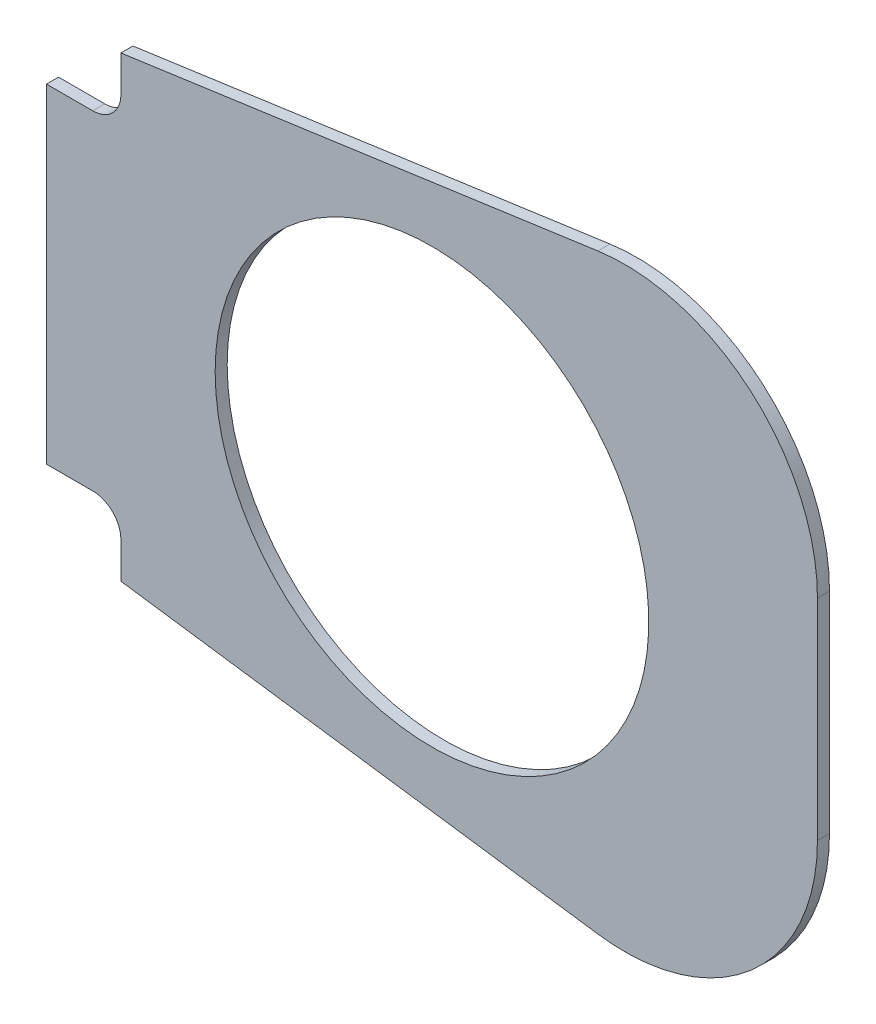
from build123d import *

# Parameters (mm, degrees)
SKETCH1_R      = 7.14375
EXTRUDE1_DEPTH = 0.1984375


with BuildPart() as part:
    # Sketch1 → Extrude1 (new, symmetric)
    with BuildSketch(Plane.XY):
        with BuildLine():
            Line((2.4511, 7.536978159), (2.4511, 6.35))
            ThreePointArc((2.4511, 6.35), (2.179558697, 5.694441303), (1.524, 5.4229))
            Line((1.524, 5.4229), (0, 5.4229))
            Line((0, 5.4229), (0, -5.4229))
            Line((0, -5.4229), (1.524, -5.4229))
            ThreePointArc((1.524, -5.4229), (2.179558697, -5.694441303), (2.4511, -6.35))
            Line((2.4511, -6.35), (2.4511, -7.536978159))
            Line((2.4511, -7.536978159), (18.166250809, -9.745598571))
            ThreePointArc((18.166250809, -9.745598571), (23.215974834, -8.249802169), (25.4, -3.457396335))
            Line((25.4, -3.457396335), (25.4, 3.457396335))
            ThreePointArc((25.4, 3.457396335), (23.215974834, 8.249802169), (18.166250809, 9.745598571))
            Line((18.166250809, 9.745598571), (2.4511, 7.536978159))
        make_face()
        with Locations(Location((12.7, 0, 0), (0, 0, 180))):
            Circle(SKETCH1_R, mode=Mode.SUBTRACT)
    extrude(amount=EXTRUDE1_DEPTH, both=True)


solid = part.part
